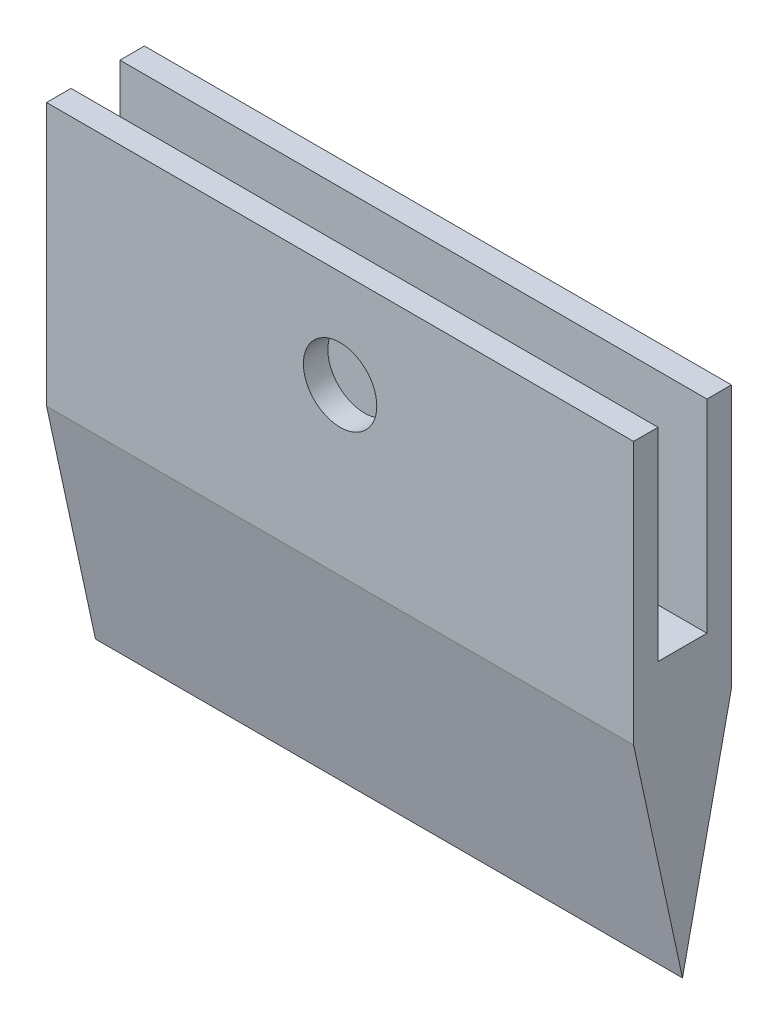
ISO-10303-21;
HEADER;
FILE_DESCRIPTION(('STEP AP214'),'2;1');
FILE_NAME('part.step','',(''),(''),'','','');
FILE_SCHEMA(('AUTOMOTIVE_DESIGN { 1 0 10303 214 1 1 1 1 }'));
ENDSEC;
DATA;
#1=APPLICATION_CONTEXT('core data for automotive mechanical design processes');
#2=APPLICATION_PROTOCOL_DEFINITION('international standard','automotive_design',2000,#1);
#3=PRODUCT_CONTEXT('',#1,'mechanical');
#4=PRODUCT('Part','Part','',(#3));
#5=PRODUCT_RELATED_PRODUCT_CATEGORY('part','',(#4));
#6=PRODUCT_DEFINITION_FORMATION('','',#4);
#7=PRODUCT_DEFINITION_CONTEXT('part definition',#1,'design');
#8=PRODUCT_DEFINITION('design','',#6,#7);
#9=PRODUCT_DEFINITION_SHAPE('','',#8);
#10=(LENGTH_UNIT() NAMED_UNIT(*) SI_UNIT(.MILLI.,.METRE.));
#11=(NAMED_UNIT(*) PLANE_ANGLE_UNIT() SI_UNIT($,.RADIAN.));
#12=(NAMED_UNIT(*) SI_UNIT($,.STERADIAN.) SOLID_ANGLE_UNIT());
#13=UNCERTAINTY_MEASURE_WITH_UNIT(LENGTH_MEASURE(1.E-05),#10,'distance_accuracy_value','');
#14=(GEOMETRIC_REPRESENTATION_CONTEXT(3) GLOBAL_UNCERTAINTY_ASSIGNED_CONTEXT((#13)) GLOBAL_UNIT_ASSIGNED_CONTEXT((#10,
#11,#12)) REPRESENTATION_CONTEXT('',''));
#15=CARTESIAN_POINT('',(0.,0.,0.));
#16=DIRECTION('',(0.,0.,1.));
#17=DIRECTION('',(1.,0.,0.));
#18=AXIS2_PLACEMENT_3D('',#15,#16,#17);
#19=CARTESIAN_POINT('',(177.8,-304.8,12.7));
#20=DIRECTION('',(1.,0.,0.));
#21=DIRECTION('',(0.,1.,0.));
#22=AXIS2_PLACEMENT_3D('',#19,#20,#21);
#23=PLANE('',#22);
#24=DIRECTION('',(0.,-1.,0.));
#25=VECTOR('',#24,1.);
#26=CARTESIAN_POINT('',(177.8,-250.549523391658,6.35000000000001));
#27=LINE('',#26,#25);
#28=CARTESIAN_POINT('',(177.8,-304.8,6.35000000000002));
#29=VERTEX_POINT('',#28);
#30=CARTESIAN_POINT('',(177.8,-357.459915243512,6.35000000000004));
#31=VERTEX_POINT('',#30);
#32=EDGE_CURVE('E131',#29,#31,#27,.T.);
#33=ORIENTED_EDGE('',*,*,#32,.T.);
#34=DIRECTION('',(0.,0.,-1.));
#35=VECTOR('',#34,1.);
#36=CARTESIAN_POINT('',(177.8,-357.459915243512,6.35000000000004));
#37=LINE('',#36,#35);
#38=CARTESIAN_POINT('',(177.8,-357.459915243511,-6.34999999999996));
#39=VERTEX_POINT('',#38);
#40=EDGE_CURVE('E122',#31,#39,#37,.T.);
#41=ORIENTED_EDGE('',*,*,#40,.T.);
#42=DIRECTION('',(0.,-1.,0.));
#43=VECTOR('',#42,1.);
#44=CARTESIAN_POINT('',(177.8,-250.549523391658,-6.34999999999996));
#45=LINE('',#44,#43);
#46=CARTESIAN_POINT('',(177.8,-304.8,-6.34999999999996));
#47=VERTEX_POINT('',#46);
#48=EDGE_CURVE('E116',#47,#39,#45,.T.);
#49=ORIENTED_EDGE('',*,*,#48,.F.);
#50=DIRECTION('',(0.,0.,-1.));
#51=VECTOR('',#50,1.);
#52=CARTESIAN_POINT('',(177.8,-304.8,12.7));
#53=LINE('',#52,#51);
#54=CARTESIAN_POINT('',(177.8,-304.8,-12.7));
#55=VERTEX_POINT('',#54);
#56=EDGE_CURVE('E167',#47,#55,#53,.T.);
#57=ORIENTED_EDGE('',*,*,#56,.T.);
#58=DIRECTION('',(0.,-1.,0.));
#59=VECTOR('',#58,1.);
#60=CARTESIAN_POINT('',(177.8,-304.8,-12.7));
#61=LINE('',#60,#59);
#62=CARTESIAN_POINT('',(177.8,-373.075062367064,-12.7));
#63=VERTEX_POINT('',#62);
#64=EDGE_CURVE('E154',#55,#63,#61,.T.);
#65=ORIENTED_EDGE('',*,*,#64,.T.);
#66=DIRECTION('',(0.,0.977404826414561,-0.2113759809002));
#67=VECTOR('',#66,1.);
#68=CARTESIAN_POINT('',(177.8,-313.098154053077,-25.6707542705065));
#69=LINE('',#68,#67);
#70=CARTESIAN_POINT('',(177.8,-431.8,0.));
#71=VERTEX_POINT('',#70);
#72=EDGE_CURVE('E144',#71,#63,#69,.T.);
#73=ORIENTED_EDGE('',*,*,#72,.F.);
#74=DIRECTION('',(0.,-0.977404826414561,-0.2113759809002));
#75=VECTOR('',#74,1.);
#76=CARTESIAN_POINT('',(177.8,-307.85051649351,26.8056213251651));
#77=LINE('',#76,#75);
#78=CARTESIAN_POINT('',(177.8,-373.075062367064,12.7));
#79=VERTEX_POINT('',#78);
#80=EDGE_CURVE('E148',#79,#71,#77,.T.);
#81=ORIENTED_EDGE('',*,*,#80,.F.);
#82=DIRECTION('',(0.,-1.,0.));
#83=VECTOR('',#82,1.);
#84=CARTESIAN_POINT('',(177.8,-304.8,12.7));
#85=LINE('',#84,#83);
#86=CARTESIAN_POINT('',(177.8,-304.8,12.7));
#87=VERTEX_POINT('',#86);
#88=EDGE_CURVE('E157',#87,#79,#85,.T.);
#89=ORIENTED_EDGE('',*,*,#88,.F.);
#90=EDGE_CURVE('E175',#87,#29,#53,.T.);
#91=ORIENTED_EDGE('',*,*,#90,.T.);
#92=EDGE_LOOP('',(#33,#41,#49,#57,#65,#73,#81,#89,#91));
#93=FACE_BOUND('',#92,.T.);
#94=ADVANCED_FACE('F32',(#93),#23,.F.);
#95=CARTESIAN_POINT('',(330.2,-304.8,12.7));
#96=DIRECTION('',(1.,0.,0.));
#97=DIRECTION('',(0.,1.,0.));
#98=AXIS2_PLACEMENT_3D('',#95,#96,#97);
#99=PLANE('',#98);
#100=DIRECTION('',(0.,0.,-1.));
#101=VECTOR('',#100,1.);
#102=CARTESIAN_POINT('',(330.2,-357.459915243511,6.35000000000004));
#103=LINE('',#102,#101);
#104=CARTESIAN_POINT('',(330.2,-357.459915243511,6.35000000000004));
#105=VERTEX_POINT('',#104);
#106=CARTESIAN_POINT('',(330.2,-357.459915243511,-6.34999999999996));
#107=VERTEX_POINT('',#106);
#108=EDGE_CURVE('E115',#105,#107,#103,.T.);
#109=ORIENTED_EDGE('',*,*,#108,.F.);
#110=DIRECTION('',(0.,-1.,0.));
#111=VECTOR('',#110,1.);
#112=CARTESIAN_POINT('',(330.2,-250.549523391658,6.35000000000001));
#113=LINE('',#112,#111);
#114=CARTESIAN_POINT('',(330.2,-304.8,6.35000000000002));
#115=VERTEX_POINT('',#114);
#116=EDGE_CURVE('E105',#115,#105,#113,.T.);
#117=ORIENTED_EDGE('',*,*,#116,.F.);
#118=DIRECTION('',(0.,0.,-1.));
#119=VECTOR('',#118,1.);
#120=CARTESIAN_POINT('',(330.2,-304.8,12.7));
#121=LINE('',#120,#119);
#122=CARTESIAN_POINT('',(330.2,-304.8,12.7));
#123=VERTEX_POINT('',#122);
#124=EDGE_CURVE('E179',#123,#115,#121,.T.);
#125=ORIENTED_EDGE('',*,*,#124,.F.);
#126=DIRECTION('',(0.,-1.,0.));
#127=VECTOR('',#126,1.);
#128=CARTESIAN_POINT('',(330.2,-304.8,12.7));
#129=LINE('',#128,#127);
#130=CARTESIAN_POINT('',(330.2,-373.075062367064,12.7));
#131=VERTEX_POINT('',#130);
#132=EDGE_CURVE('E160',#123,#131,#129,.T.);
#133=ORIENTED_EDGE('',*,*,#132,.T.);
#134=DIRECTION('',(0.,-0.977404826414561,-0.2113759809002));
#135=VECTOR('',#134,1.);
#136=CARTESIAN_POINT('',(330.2,-307.85051649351,26.8056213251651));
#137=LINE('',#136,#135);
#138=CARTESIAN_POINT('',(330.2,-431.8,0.));
#139=VERTEX_POINT('',#138);
#140=EDGE_CURVE('E11',#131,#139,#137,.T.);
#141=ORIENTED_EDGE('',*,*,#140,.T.);
#142=DIRECTION('',(0.,0.977404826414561,-0.2113759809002));
#143=VECTOR('',#142,1.);
#144=CARTESIAN_POINT('',(330.2,-313.098154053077,-25.6707542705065));
#145=LINE('',#144,#143);
#146=CARTESIAN_POINT('',(330.2,-373.075062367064,-12.7));
#147=VERTEX_POINT('',#146);
#148=EDGE_CURVE('E40',#139,#147,#145,.T.);
#149=ORIENTED_EDGE('',*,*,#148,.T.);
#150=DIRECTION('',(0.,-1.,0.));
#151=VECTOR('',#150,1.);
#152=CARTESIAN_POINT('',(330.2,-304.8,-12.7));
#153=LINE('',#152,#151);
#154=CARTESIAN_POINT('',(330.2,-304.8,-12.7));
#155=VERTEX_POINT('',#154);
#156=EDGE_CURVE('E170',#155,#147,#153,.T.);
#157=ORIENTED_EDGE('',*,*,#156,.F.);
#158=CARTESIAN_POINT('',(330.2,-304.8,-6.34999999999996));
#159=VERTEX_POINT('',#158);
#160=EDGE_CURVE('E178',#159,#155,#121,.T.);
#161=ORIENTED_EDGE('',*,*,#160,.F.);
#162=DIRECTION('',(0.,-1.,0.));
#163=VECTOR('',#162,1.);
#164=CARTESIAN_POINT('',(330.2,-250.549523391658,-6.34999999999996));
#165=LINE('',#164,#163);
#166=EDGE_CURVE('E48',#159,#107,#165,.T.);
#167=ORIENTED_EDGE('',*,*,#166,.T.);
#168=EDGE_LOOP('',(#109,#117,#125,#133,#141,#149,#157,#161,#167));
#169=FACE_BOUND('',#168,.T.);
#170=ADVANCED_FACE('F126',(#169),#99,.T.);
#171=CARTESIAN_POINT('',(177.8,-304.8,12.7));
#172=DIRECTION('',(0.,1.,0.));
#173=DIRECTION('',(0.,0.,1.));
#174=AXIS2_PLACEMENT_3D('',#171,#172,#173);
#175=PLANE('',#174);
#176=ORIENTED_EDGE('',*,*,#124,.T.);
#177=DIRECTION('',(-1.,0.,0.));
#178=VECTOR('',#177,1.);
#179=CARTESIAN_POINT('',(177.8,-304.8,6.35000000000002));
#180=LINE('',#179,#178);
#181=EDGE_CURVE('E111',#115,#29,#180,.T.);
#182=ORIENTED_EDGE('',*,*,#181,.T.);
#183=ORIENTED_EDGE('',*,*,#90,.F.);
#184=DIRECTION('',(1.,0.,0.));
#185=VECTOR('',#184,1.);
#186=CARTESIAN_POINT('',(177.8,-304.8,12.7));
#187=LINE('',#186,#185);
#188=EDGE_CURVE('E164',#87,#123,#187,.T.);
#189=ORIENTED_EDGE('',*,*,#188,.T.);
#190=EDGE_LOOP('',(#176,#182,#183,#189));
#191=FACE_BOUND('',#190,.T.);
#192=ADVANCED_FACE('F217',(#191),#175,.T.);
#193=CARTESIAN_POINT('',(254.,-330.2,12.7));
#194=DIRECTION('',(0.,0.,-1.));
#195=DIRECTION('',(-1.,0.,0.));
#196=AXIS2_PLACEMENT_3D('',#193,#194,#195);
#197=CYLINDRICAL_SURFACE('',#196,9.52500000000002);
#198=CARTESIAN_POINT('',(254.,-330.2,12.7));
#199=DIRECTION('',(0.,0.,1.));
#200=DIRECTION('',(1.,0.,0.));
#201=AXIS2_PLACEMENT_3D('',#198,#199,#200);
#202=CIRCLE('',#201,9.52500000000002);
#203=CARTESIAN_POINT('',(263.525,-330.2,12.7));
#204=VERTEX_POINT('',#203);
#205=EDGE_CURVE('E151',#204,#204,#202,.T.);
#206=ORIENTED_EDGE('',*,*,#205,.T.);
#207=EDGE_LOOP('',(#206));
#208=FACE_BOUND('',#207,.T.);
#209=CARTESIAN_POINT('',(254.,-330.2,6.35000000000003));
#210=DIRECTION('',(0.,0.,-1.));
#211=DIRECTION('',(0.,1.,0.));
#212=AXIS2_PLACEMENT_3D('',#209,#210,#211);
#213=CIRCLE('',#212,9.52500000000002);
#214=CARTESIAN_POINT('',(254.,-320.675,6.35000000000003));
#215=VERTEX_POINT('',#214);
#216=EDGE_CURVE('E35',#215,#215,#213,.T.);
#217=ORIENTED_EDGE('',*,*,#216,.T.);
#218=EDGE_LOOP('',(#217));
#219=FACE_BOUND('',#218,.T.);
#220=ADVANCED_FACE('F192',(#208,#219),#197,.F.);
#221=CARTESIAN_POINT('',(0.,0.,12.7));
#222=DIRECTION('',(0.,0.,1.));
#223=DIRECTION('',(1.,0.,0.));
#224=AXIS2_PLACEMENT_3D('',#221,#222,#223);
#225=PLANE('',#224);
#226=ORIENTED_EDGE('',*,*,#205,.F.);
#227=EDGE_LOOP('',(#226));
#228=FACE_BOUND('',#227,.T.);
#229=ORIENTED_EDGE('',*,*,#88,.T.);
#230=DIRECTION('',(1.,0.,0.));
#231=VECTOR('',#230,1.);
#232=CARTESIAN_POINT('',(-72.1997499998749,-373.075062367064,12.7));
#233=LINE('',#232,#231);
#234=EDGE_CURVE('E141',#79,#131,#233,.T.);
#235=ORIENTED_EDGE('',*,*,#234,.T.);
#236=ORIENTED_EDGE('',*,*,#132,.F.);
#237=ORIENTED_EDGE('',*,*,#188,.F.);
#238=EDGE_LOOP('',(#229,#235,#236,#237));
#239=FACE_BOUND('',#238,.T.);
#240=ADVANCED_FACE('F198',(#228,#239),#225,.T.);
#241=CARTESIAN_POINT('',(0.,0.,-12.7));
#242=DIRECTION('',(0.,0.,1.));
#243=DIRECTION('',(1.,0.,0.));
#244=AXIS2_PLACEMENT_3D('',#241,#242,#243);
#245=PLANE('',#244);
#246=CARTESIAN_POINT('',(254.,-330.2,-12.7));
#247=DIRECTION('',(0.,0.,1.));
#248=DIRECTION('',(1.,0.,0.));
#249=AXIS2_PLACEMENT_3D('',#246,#247,#248);
#250=CIRCLE('',#249,9.52500000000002);
#251=CARTESIAN_POINT('',(263.525,-330.2,-12.7));
#252=VERTEX_POINT('',#251);
#253=EDGE_CURVE('E150',#252,#252,#250,.T.);
#254=ORIENTED_EDGE('',*,*,#253,.T.);
#255=EDGE_LOOP('',(#254));
#256=FACE_BOUND('',#255,.T.);
#257=DIRECTION('',(1.,0.,0.));
#258=VECTOR('',#257,1.);
#259=CARTESIAN_POINT('',(-72.1997499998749,-373.075062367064,-12.7));
#260=LINE('',#259,#258);
#261=EDGE_CURVE('E56',#63,#147,#260,.T.);
#262=ORIENTED_EDGE('',*,*,#261,.F.);
#263=ORIENTED_EDGE('',*,*,#64,.F.);
#264=DIRECTION('',(1.,0.,0.));
#265=VECTOR('',#264,1.);
#266=CARTESIAN_POINT('',(177.8,-304.8,-12.7));
#267=LINE('',#266,#265);
#268=EDGE_CURVE('E161',#55,#155,#267,.T.);
#269=ORIENTED_EDGE('',*,*,#268,.T.);
#270=ORIENTED_EDGE('',*,*,#156,.T.);
#271=EDGE_LOOP('',(#262,#263,#269,#270));
#272=FACE_BOUND('',#271,.T.);
#273=ADVANCED_FACE('F195',(#256,#272),#245,.F.);
#274=DIRECTION('',(-1.,0.,0.));
#275=VECTOR('',#274,1.);
#276=CARTESIAN_POINT('',(177.8,-304.8,-6.34999999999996));
#277=LINE('',#276,#275);
#278=EDGE_CURVE('E136',#159,#47,#277,.T.);
#279=ORIENTED_EDGE('',*,*,#278,.F.);
#280=ORIENTED_EDGE('',*,*,#160,.T.);
#281=ORIENTED_EDGE('',*,*,#268,.F.);
#282=ORIENTED_EDGE('',*,*,#56,.F.);
#283=EDGE_LOOP('',(#279,#280,#281,#282));
#284=FACE_BOUND('',#283,.T.);
#285=ADVANCED_FACE('F190',(#284),#175,.T.);
#286=CARTESIAN_POINT('',(254.,-330.2,-6.34999999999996));
#287=DIRECTION('',(0.,0.,-1.));
#288=DIRECTION('',(-1.,0.,0.));
#289=AXIS2_PLACEMENT_3D('',#286,#287,#288);
#290=CIRCLE('',#289,9.52500000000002);
#291=CARTESIAN_POINT('',(244.475,-330.2,-6.34999999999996));
#292=VERTEX_POINT('',#291);
#293=EDGE_CURVE('E123',#292,#292,#290,.T.);
#294=ORIENTED_EDGE('',*,*,#293,.F.);
#295=EDGE_LOOP('',(#294));
#296=FACE_BOUND('',#295,.T.);
#297=ORIENTED_EDGE('',*,*,#253,.F.);
#298=EDGE_LOOP('',(#297));
#299=FACE_BOUND('',#298,.T.);
#300=ADVANCED_FACE('F186',(#296,#299),#197,.F.);
#301=CARTESIAN_POINT('',(-72.1997499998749,-431.8,0.));
#302=DIRECTION('',(0.,-0.2113759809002,0.977404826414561));
#303=DIRECTION('',(0.,-0.977404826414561,-0.2113759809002));
#304=AXIS2_PLACEMENT_3D('',#301,#302,#303);
#305=PLANE('',#304);
#306=ORIENTED_EDGE('',*,*,#234,.F.);
#307=ORIENTED_EDGE('',*,*,#80,.T.);
#308=DIRECTION('',(1.,0.,0.));
#309=VECTOR('',#308,1.);
#310=CARTESIAN_POINT('',(-72.1997499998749,-431.8,0.));
#311=LINE('',#310,#309);
#312=EDGE_CURVE('E139',#71,#139,#311,.T.);
#313=ORIENTED_EDGE('',*,*,#312,.T.);
#314=ORIENTED_EDGE('',*,*,#140,.F.);
#315=EDGE_LOOP('',(#306,#307,#313,#314));
#316=FACE_BOUND('',#315,.T.);
#317=ADVANCED_FACE('F189',(#316),#305,.T.);
#318=CARTESIAN_POINT('',(-72.1997499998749,-431.8,0.));
#319=DIRECTION('',(0.,-0.2113759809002,-0.977404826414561));
#320=DIRECTION('',(0.,0.977404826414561,-0.2113759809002));
#321=AXIS2_PLACEMENT_3D('',#318,#319,#320);
#322=PLANE('',#321);
#323=ORIENTED_EDGE('',*,*,#312,.F.);
#324=ORIENTED_EDGE('',*,*,#72,.T.);
#325=ORIENTED_EDGE('',*,*,#261,.T.);
#326=ORIENTED_EDGE('',*,*,#148,.F.);
#327=EDGE_LOOP('',(#323,#324,#325,#326));
#328=FACE_BOUND('',#327,.T.);
#329=ADVANCED_FACE('F210',(#328),#322,.T.);
#330=CARTESIAN_POINT('',(330.2,-250.549523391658,6.35000000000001));
#331=DIRECTION('',(0.,0.,-1.));
#332=DIRECTION('',(0.,1.,0.));
#333=AXIS2_PLACEMENT_3D('',#330,#331,#332);
#334=PLANE('',#333);
#335=ORIENTED_EDGE('',*,*,#216,.F.);
#336=EDGE_LOOP('',(#335));
#337=FACE_BOUND('',#336,.T.);
#338=ORIENTED_EDGE('',*,*,#116,.T.);
#339=DIRECTION('',(-1.,0.,0.));
#340=VECTOR('',#339,1.);
#341=CARTESIAN_POINT('',(330.2,-357.459915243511,6.35000000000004));
#342=LINE('',#341,#340);
#343=EDGE_CURVE('E108',#105,#31,#342,.T.);
#344=ORIENTED_EDGE('',*,*,#343,.T.);
#345=ORIENTED_EDGE('',*,*,#32,.F.);
#346=ORIENTED_EDGE('',*,*,#181,.F.);
#347=EDGE_LOOP('',(#338,#344,#345,#346));
#348=FACE_BOUND('',#347,.T.);
#349=ADVANCED_FACE('F107',(#337,#348),#334,.T.);
#350=CARTESIAN_POINT('',(330.2,-357.459915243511,6.35000000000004));
#351=DIRECTION('',(0.,1.,0.));
#352=DIRECTION('',(0.,0.,1.));
#353=AXIS2_PLACEMENT_3D('',#350,#351,#352);
#354=PLANE('',#353);
#355=ORIENTED_EDGE('',*,*,#40,.F.);
#356=ORIENTED_EDGE('',*,*,#343,.F.);
#357=ORIENTED_EDGE('',*,*,#108,.T.);
#358=DIRECTION('',(-1.,0.,0.));
#359=VECTOR('',#358,1.);
#360=CARTESIAN_POINT('',(330.2,-357.459915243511,-6.34999999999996));
#361=LINE('',#360,#359);
#362=EDGE_CURVE('E124',#107,#39,#361,.T.);
#363=ORIENTED_EDGE('',*,*,#362,.T.);
#364=EDGE_LOOP('',(#355,#356,#357,#363));
#365=FACE_BOUND('',#364,.T.);
#366=ADVANCED_FACE('F119',(#365),#354,.T.);
#367=CARTESIAN_POINT('',(330.2,-250.549523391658,-6.34999999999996));
#368=DIRECTION('',(0.,0.,-1.));
#369=DIRECTION('',(-1.,0.,0.));
#370=AXIS2_PLACEMENT_3D('',#367,#368,#369);
#371=PLANE('',#370);
#372=ORIENTED_EDGE('',*,*,#278,.T.);
#373=ORIENTED_EDGE('',*,*,#48,.T.);
#374=ORIENTED_EDGE('',*,*,#362,.F.);
#375=ORIENTED_EDGE('',*,*,#166,.F.);
#376=EDGE_LOOP('',(#372,#373,#374,#375));
#377=FACE_BOUND('',#376,.T.);
#378=ORIENTED_EDGE('',*,*,#293,.T.);
#379=EDGE_LOOP('',(#378));
#380=FACE_BOUND('',#379,.T.);
#381=ADVANCED_FACE('F184',(#377,#380),#371,.F.);
#382=CLOSED_SHELL('',(#94,#170,#192,#220,#240,#273,#285,#300,#317,#329,#349,#366,#381));
#383=MANIFOLD_SOLID_BREP('B2',#382);
#384=ADVANCED_BREP_SHAPE_REPRESENTATION('',(#18,#383),#14);
#385=SHAPE_DEFINITION_REPRESENTATION(#9,#384);
ENDSEC;
END-ISO-10303-21;
